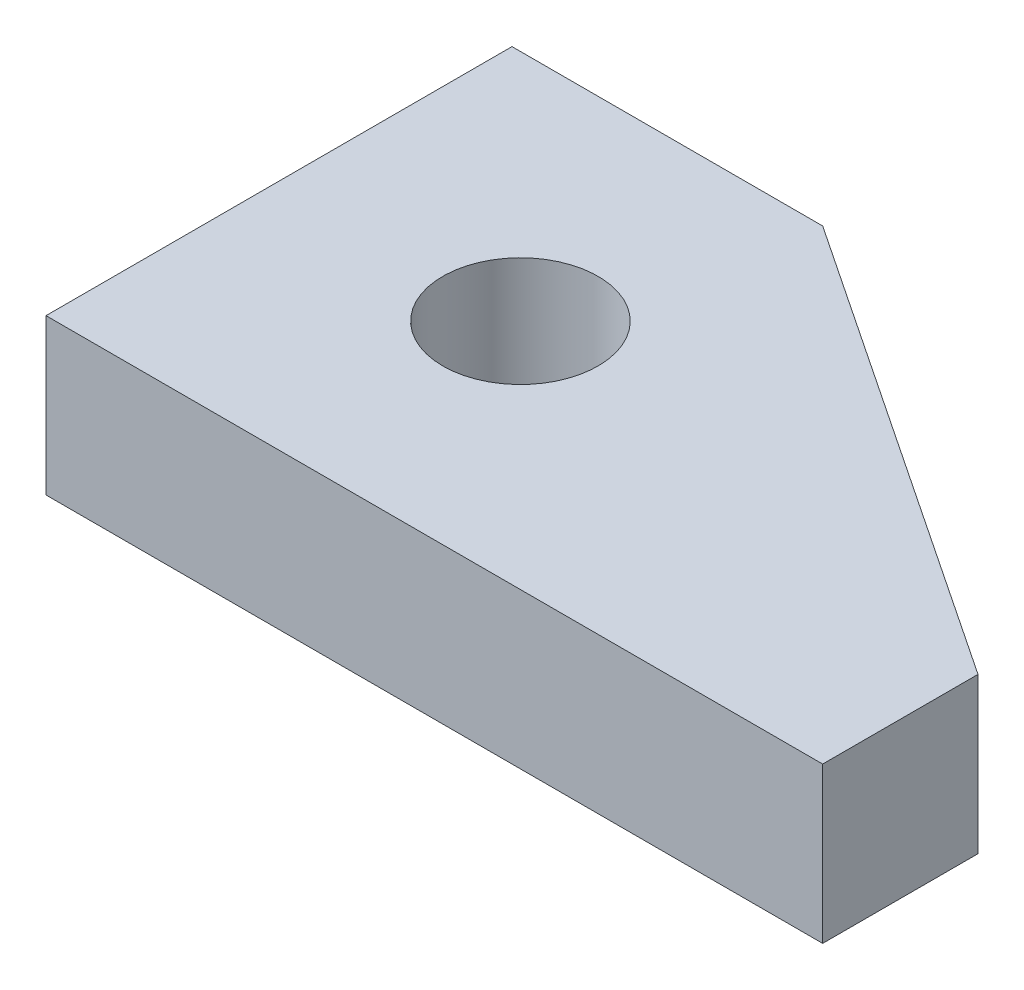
ISO-10303-21;
HEADER;
FILE_DESCRIPTION(('STEP AP214'),'2;1');
FILE_NAME('part.step','',(''),(''),'','','');
FILE_SCHEMA(('AUTOMOTIVE_DESIGN { 1 0 10303 214 1 1 1 1 }'));
ENDSEC;
DATA;
#1=APPLICATION_CONTEXT('core data for automotive mechanical design processes');
#2=APPLICATION_PROTOCOL_DEFINITION('international standard','automotive_design',2000,#1);
#3=PRODUCT_CONTEXT('',#1,'mechanical');
#4=PRODUCT('Part','Part','',(#3));
#5=PRODUCT_RELATED_PRODUCT_CATEGORY('part','',(#4));
#6=PRODUCT_DEFINITION_FORMATION('','',#4);
#7=PRODUCT_DEFINITION_CONTEXT('part definition',#1,'design');
#8=PRODUCT_DEFINITION('design','',#6,#7);
#9=PRODUCT_DEFINITION_SHAPE('','',#8);
#10=(LENGTH_UNIT() NAMED_UNIT(*) SI_UNIT(.MILLI.,.METRE.));
#11=(NAMED_UNIT(*) PLANE_ANGLE_UNIT() SI_UNIT($,.RADIAN.));
#12=(NAMED_UNIT(*) SI_UNIT($,.STERADIAN.) SOLID_ANGLE_UNIT());
#13=UNCERTAINTY_MEASURE_WITH_UNIT(LENGTH_MEASURE(1.E-05),#10,'distance_accuracy_value','');
#14=(GEOMETRIC_REPRESENTATION_CONTEXT(3) GLOBAL_UNCERTAINTY_ASSIGNED_CONTEXT((#13)) GLOBAL_UNIT_ASSIGNED_CONTEXT((#10,
#11,#12)) REPRESENTATION_CONTEXT('',''));
#15=CARTESIAN_POINT('',(0.,0.,0.));
#16=DIRECTION('',(0.,0.,1.));
#17=DIRECTION('',(1.,0.,0.));
#18=AXIS2_PLACEMENT_3D('',#15,#16,#17);
#19=CARTESIAN_POINT('',(0.,10.,0.));
#20=DIRECTION('',(0.,0.,1.));
#21=DIRECTION('',(1.,0.,0.));
#22=AXIS2_PLACEMENT_3D('',#19,#20,#21);
#23=PLANE('',#22);
#24=DIRECTION('',(-1.,0.,0.));
#25=VECTOR('',#24,1.);
#26=CARTESIAN_POINT('',(0.,0.,0.));
#27=LINE('',#26,#25);
#28=CARTESIAN_POINT('',(20.,0.,0.));
#29=VERTEX_POINT('',#28);
#30=CARTESIAN_POINT('',(0.,0.,0.));
#31=VERTEX_POINT('',#30);
#32=EDGE_CURVE('E124',#29,#31,#27,.T.);
#33=ORIENTED_EDGE('',*,*,#32,.T.);
#34=DIRECTION('',(0.,-1.,0.));
#35=VECTOR('',#34,1.);
#36=CARTESIAN_POINT('',(0.,10.,0.));
#37=LINE('',#36,#35);
#38=CARTESIAN_POINT('',(0.,10.,0.));
#39=VERTEX_POINT('',#38);
#40=EDGE_CURVE('E11',#39,#31,#37,.T.);
#41=ORIENTED_EDGE('',*,*,#40,.F.);
#42=DIRECTION('',(-1.,0.,0.));
#43=VECTOR('',#42,1.);
#44=CARTESIAN_POINT('',(0.,10.,0.));
#45=LINE('',#44,#43);
#46=CARTESIAN_POINT('',(20.,10.,0.));
#47=VERTEX_POINT('',#46);
#48=EDGE_CURVE('E138',#47,#39,#45,.T.);
#49=ORIENTED_EDGE('',*,*,#48,.F.);
#50=DIRECTION('',(0.,-1.,0.));
#51=VECTOR('',#50,1.);
#52=CARTESIAN_POINT('',(20.,10.,0.));
#53=LINE('',#52,#51);
#54=EDGE_CURVE('E120',#47,#29,#53,.T.);
#55=ORIENTED_EDGE('',*,*,#54,.T.);
#56=EDGE_LOOP('',(#33,#41,#49,#55));
#57=FACE_BOUND('',#56,.T.);
#58=ADVANCED_FACE('F45',(#57),#23,.F.);
#59=CARTESIAN_POINT('',(0.,10.,0.));
#60=DIRECTION('',(1.,0.,0.));
#61=DIRECTION('',(0.,0.,-1.));
#62=AXIS2_PLACEMENT_3D('',#59,#60,#61);
#63=PLANE('',#62);
#64=DIRECTION('',(0.,0.,1.));
#65=VECTOR('',#64,1.);
#66=CARTESIAN_POINT('',(0.,0.,0.));
#67=LINE('',#66,#65);
#68=CARTESIAN_POINT('',(0.,0.,30.));
#69=VERTEX_POINT('',#68);
#70=EDGE_CURVE('E128',#31,#69,#67,.T.);
#71=ORIENTED_EDGE('',*,*,#70,.T.);
#72=DIRECTION('',(0.,-1.,0.));
#73=VECTOR('',#72,1.);
#74=CARTESIAN_POINT('',(0.,10.,30.));
#75=LINE('',#74,#73);
#76=CARTESIAN_POINT('',(0.,10.,30.));
#77=VERTEX_POINT('',#76);
#78=EDGE_CURVE('E54',#77,#69,#75,.T.);
#79=ORIENTED_EDGE('',*,*,#78,.F.);
#80=DIRECTION('',(0.,0.,1.));
#81=VECTOR('',#80,1.);
#82=CARTESIAN_POINT('',(0.,10.,0.));
#83=LINE('',#82,#81);
#84=EDGE_CURVE('E96',#39,#77,#83,.T.);
#85=ORIENTED_EDGE('',*,*,#84,.F.);
#86=ORIENTED_EDGE('',*,*,#40,.T.);
#87=EDGE_LOOP('',(#71,#79,#85,#86));
#88=FACE_BOUND('',#87,.T.);
#89=ADVANCED_FACE('F161',(#88),#63,.F.);
#90=CARTESIAN_POINT('',(0.,10.,30.));
#91=DIRECTION('',(0.,0.,-1.));
#92=DIRECTION('',(-1.,0.,0.));
#93=AXIS2_PLACEMENT_3D('',#90,#91,#92);
#94=PLANE('',#93);
#95=DIRECTION('',(1.,0.,0.));
#96=VECTOR('',#95,1.);
#97=CARTESIAN_POINT('',(0.,0.,30.));
#98=LINE('',#97,#96);
#99=CARTESIAN_POINT('',(50.,0.,30.));
#100=VERTEX_POINT('',#99);
#101=EDGE_CURVE('E112',#69,#100,#98,.T.);
#102=ORIENTED_EDGE('',*,*,#101,.T.);
#103=DIRECTION('',(0.,-1.,0.));
#104=VECTOR('',#103,1.);
#105=CARTESIAN_POINT('',(50.,10.,30.));
#106=LINE('',#105,#104);
#107=CARTESIAN_POINT('',(50.,10.,30.));
#108=VERTEX_POINT('',#107);
#109=EDGE_CURVE('E109',#108,#100,#106,.T.);
#110=ORIENTED_EDGE('',*,*,#109,.F.);
#111=DIRECTION('',(1.,0.,0.));
#112=VECTOR('',#111,1.);
#113=CARTESIAN_POINT('',(0.,10.,30.));
#114=LINE('',#113,#112);
#115=EDGE_CURVE('E100',#77,#108,#114,.T.);
#116=ORIENTED_EDGE('',*,*,#115,.F.);
#117=ORIENTED_EDGE('',*,*,#78,.T.);
#118=EDGE_LOOP('',(#102,#110,#116,#117));
#119=FACE_BOUND('',#118,.T.);
#120=ADVANCED_FACE('F110',(#119),#94,.F.);
#121=CARTESIAN_POINT('',(50.,10.,30.));
#122=DIRECTION('',(-1.,0.,0.));
#123=DIRECTION('',(0.,0.,1.));
#124=AXIS2_PLACEMENT_3D('',#121,#122,#123);
#125=PLANE('',#124);
#126=DIRECTION('',(0.,0.,-1.));
#127=VECTOR('',#126,1.);
#128=CARTESIAN_POINT('',(50.,0.,30.));
#129=LINE('',#128,#127);
#130=CARTESIAN_POINT('',(50.,0.,20.));
#131=VERTEX_POINT('',#130);
#132=EDGE_CURVE('E82',#100,#131,#129,.T.);
#133=ORIENTED_EDGE('',*,*,#132,.T.);
#134=DIRECTION('',(0.,-1.,0.));
#135=VECTOR('',#134,1.);
#136=CARTESIAN_POINT('',(50.,10.,20.));
#137=LINE('',#136,#135);
#138=CARTESIAN_POINT('',(50.,10.,20.));
#139=VERTEX_POINT('',#138);
#140=EDGE_CURVE('E114',#139,#131,#137,.T.);
#141=ORIENTED_EDGE('',*,*,#140,.F.);
#142=DIRECTION('',(0.,0.,-1.));
#143=VECTOR('',#142,1.);
#144=CARTESIAN_POINT('',(50.,10.,30.));
#145=LINE('',#144,#143);
#146=EDGE_CURVE('E104',#108,#139,#145,.T.);
#147=ORIENTED_EDGE('',*,*,#146,.F.);
#148=ORIENTED_EDGE('',*,*,#109,.T.);
#149=EDGE_LOOP('',(#133,#141,#147,#148));
#150=FACE_BOUND('',#149,.T.);
#151=ADVANCED_FACE('F116',(#150),#125,.F.);
#152=CARTESIAN_POINT('',(20.,10.,0.));
#153=DIRECTION('',(-0.554700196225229,0.,0.832050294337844));
#154=DIRECTION('',(0.832050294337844,0.,0.554700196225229));
#155=AXIS2_PLACEMENT_3D('',#152,#153,#154);
#156=PLANE('',#155);
#157=DIRECTION('',(-0.832050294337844,0.,-0.554700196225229));
#158=VECTOR('',#157,1.);
#159=CARTESIAN_POINT('',(20.,0.,0.));
#160=LINE('',#159,#158);
#161=EDGE_CURVE('E88',#131,#29,#160,.T.);
#162=ORIENTED_EDGE('',*,*,#161,.T.);
#163=ORIENTED_EDGE('',*,*,#54,.F.);
#164=DIRECTION('',(-0.832050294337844,0.,-0.554700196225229));
#165=VECTOR('',#164,1.);
#166=CARTESIAN_POINT('',(20.,10.,0.));
#167=LINE('',#166,#165);
#168=EDGE_CURVE('E62',#139,#47,#167,.T.);
#169=ORIENTED_EDGE('',*,*,#168,.F.);
#170=ORIENTED_EDGE('',*,*,#140,.T.);
#171=EDGE_LOOP('',(#162,#163,#169,#170));
#172=FACE_BOUND('',#171,.T.);
#173=ADVANCED_FACE('F149',(#172),#156,.F.);
#174=CARTESIAN_POINT('',(0.,10.,0.));
#175=DIRECTION('',(0.,1.,0.));
#176=DIRECTION('',(0.,0.,1.));
#177=AXIS2_PLACEMENT_3D('',#174,#175,#176);
#178=PLANE('',#177);
#179=CARTESIAN_POINT('',(15.5791711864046,10.,15.036095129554));
#180=DIRECTION('',(0.,1.,0.));
#181=DIRECTION('',(0.,0.,1.));
#182=AXIS2_PLACEMENT_3D('',#179,#180,#181);
#183=CIRCLE('',#182,5.);
#184=CARTESIAN_POINT('',(15.5791711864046,10.,20.036095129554));
#185=VERTEX_POINT('',#184);
#186=EDGE_CURVE('E254',#185,#185,#183,.T.);
#187=ORIENTED_EDGE('',*,*,#186,.F.);
#188=EDGE_LOOP('',(#187));
#189=FACE_BOUND('',#188,.T.);
#190=ORIENTED_EDGE('',*,*,#48,.T.);
#191=ORIENTED_EDGE('',*,*,#84,.T.);
#192=ORIENTED_EDGE('',*,*,#115,.T.);
#193=ORIENTED_EDGE('',*,*,#146,.T.);
#194=ORIENTED_EDGE('',*,*,#168,.T.);
#195=EDGE_LOOP('',(#190,#191,#192,#193,#194));
#196=FACE_BOUND('',#195,.T.);
#197=ADVANCED_FACE('F102',(#189,#196),#178,.T.);
#198=CARTESIAN_POINT('',(0.,0.,0.));
#199=DIRECTION('',(0.,1.,0.));
#200=DIRECTION('',(0.,0.,1.));
#201=AXIS2_PLACEMENT_3D('',#198,#199,#200);
#202=PLANE('',#201);
#203=CARTESIAN_POINT('',(15.5791711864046,0.,15.036095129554));
#204=DIRECTION('',(0.,1.,0.));
#205=DIRECTION('',(0.,0.,1.));
#206=AXIS2_PLACEMENT_3D('',#203,#204,#205);
#207=CIRCLE('',#206,5.);
#208=CARTESIAN_POINT('',(15.5791711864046,0.,20.036095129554));
#209=VERTEX_POINT('',#208);
#210=EDGE_CURVE('E129',#209,#209,#207,.T.);
#211=ORIENTED_EDGE('',*,*,#210,.T.);
#212=EDGE_LOOP('',(#211));
#213=FACE_BOUND('',#212,.T.);
#214=ORIENTED_EDGE('',*,*,#32,.F.);
#215=ORIENTED_EDGE('',*,*,#161,.F.);
#216=ORIENTED_EDGE('',*,*,#132,.F.);
#217=ORIENTED_EDGE('',*,*,#101,.F.);
#218=ORIENTED_EDGE('',*,*,#70,.F.);
#219=EDGE_LOOP('',(#214,#215,#216,#217,#218));
#220=FACE_BOUND('',#219,.T.);
#221=ADVANCED_FACE('F145',(#213,#220),#202,.F.);
#222=CARTESIAN_POINT('',(15.5791711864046,0.,15.036095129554));
#223=DIRECTION('',(0.,1.,0.));
#224=DIRECTION('',(0.,0.,1.));
#225=AXIS2_PLACEMENT_3D('',#222,#223,#224);
#226=CYLINDRICAL_SURFACE('',#225,5.);
#227=ORIENTED_EDGE('',*,*,#210,.F.);
#228=EDGE_LOOP('',(#227));
#229=FACE_BOUND('',#228,.T.);
#230=ORIENTED_EDGE('',*,*,#186,.T.);
#231=EDGE_LOOP('',(#230));
#232=FACE_BOUND('',#231,.T.);
#233=ADVANCED_FACE('F194',(#229,#232),#226,.F.);
#234=CLOSED_SHELL('',(#58,#89,#120,#151,#173,#197,#221,#233));
#235=MANIFOLD_SOLID_BREP('B2',#234);
#236=ADVANCED_BREP_SHAPE_REPRESENTATION('',(#18,#235),#14);
#237=SHAPE_DEFINITION_REPRESENTATION(#9,#236);
ENDSEC;
END-ISO-10303-21;
